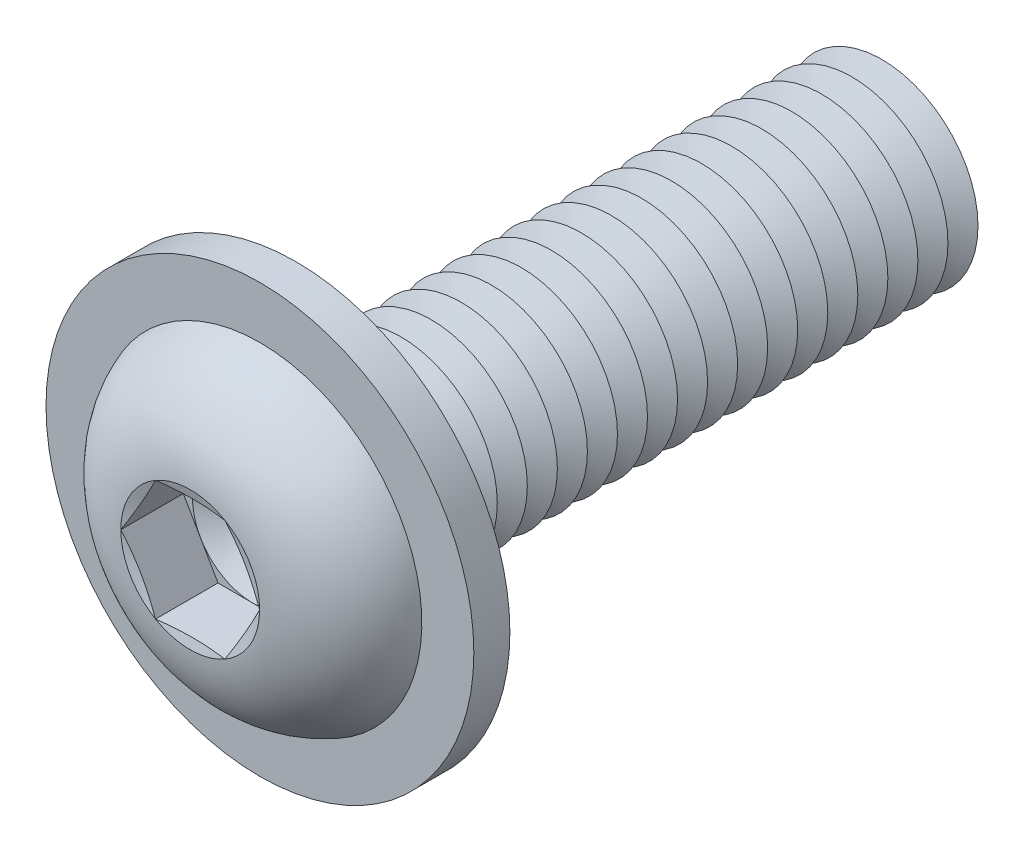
from build123d import *

# Parameters (mm, degrees)
FILLET1_R           = 0.625
LPATTERN1_COUNT     = 20
LPATTERN1_PITCH     = 1.25
CUT_EXTRUDE1_DEPTH  = 2.6
SKETCH5_R           = 8.9
SKETCH5_R_2         = 4.625
BOSS_EXTRUDE1_DEPTH = 1.5


with BuildPart() as part:
    # Sketch1 → Revolve1 (revolve)
    with BuildSketch(Plane(origin=(0, 0, 0), x_dir=(0, 0, -1), z_dir=(1, 0, 0)), mode=Mode.PRIVATE) as revolve1_sk:
        with BuildLine():
            Line((0, 4), (0, 7))
            ThreePointArc((0, 7), (-3.011595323, 5.81154966), (-4.4, 2.88675))
            Line((-4.4, 2.88675), (-4.013248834, 1.443375))
            Line((-4.013248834, 1.443375), (-4.4, 1.443375))
            Line((-4.4, 1.443375), (-4.4, 0))
            Line((-4.4, 0), (25, 0))
            Line((25, 0), (25, 4))
            Line((25, 4), (0, 4))
        make_face()
    revolve(revolve1_sk.sketch.rotate(Axis((0, 0, -25), (0, 0, 1)), 90), axis=Axis((0, 0, -25), (0, 0, 1)))

    # Fillet1
    fillet1_edges = [part.edges().sort_by_distance(p)[0] for p in [
        (4, 0, 0),
    ]]
    fillet(fillet1_edges, radius=FILLET1_R)

    # Sketch2 → Cut-Revolve1 (revolve, cut)
    with BuildSketch(Plane(origin=(0, 0, 0), x_dir=(0, 0, -1), z_dir=(1, 0, 0)), mode=Mode.PRIVATE) as cut_revolve1_sk:
        Polygon((24.375, 4), (25.625, 4), (25, 2.917468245), align=None)
    cut_revolve1 = revolve(cut_revolve1_sk.sketch.rotate(Axis((0, 0, -25), (0, 0, -1)), 270), axis=Axis((0, 0, -25), (0, 0, -1)), mode=Mode.SUBTRACT)

    # LPattern1: Cut-Revolve1 ×20
    with Locations(*[(0, 0, i * LPATTERN1_PITCH) for i in range(1, LPATTERN1_COUNT)]):
        add(cut_revolve1, mode=Mode.SUBTRACT)

    # Sketch3 → Cut-Extrude1 (cut)
    with BuildSketch(Plane.XY.offset(4.4)):
        Polygon((1.443375, 2.499998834), (-1.443375, 2.499998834), (-2.88675, 0), (-1.443375, -2.499998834), (1.443375, -2.499998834), (2.88675, 0), align=None)
    extrude(amount=-CUT_EXTRUDE1_DEPTH, mode=Mode.SUBTRACT)

    # Cut-Extrude2 cone 1 section (on through the dimple's axis) → Cut-Extrude2 (revolve, cut)
    with BuildSketch(Plane(origin=(0, 0, 1.8), x_dir=(0, -1, 0), z_dir=(1, 0, 0))):
        Polygon((0, 0), (2.499998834, 0), (0, 1.443375), align=None)
    revolve(axis=Axis((0, 0, 1.8), (0, 0, -1)), mode=Mode.SUBTRACT)

    # Sketch5 → Boss-Extrude1 (add)
    with BuildSketch(Plane(origin=(0, 0, 0), x_dir=(-1, 0, 0), z_dir=(0, 0, -1))):
        with Locations(Location((0, 0, 0), (0, 0, 90))):
            Circle(SKETCH5_R)
        Circle(SKETCH5_R_2, mode=Mode.SUBTRACT)
    extrude(amount=-BOSS_EXTRUDE1_DEPTH)


solid = part.part
